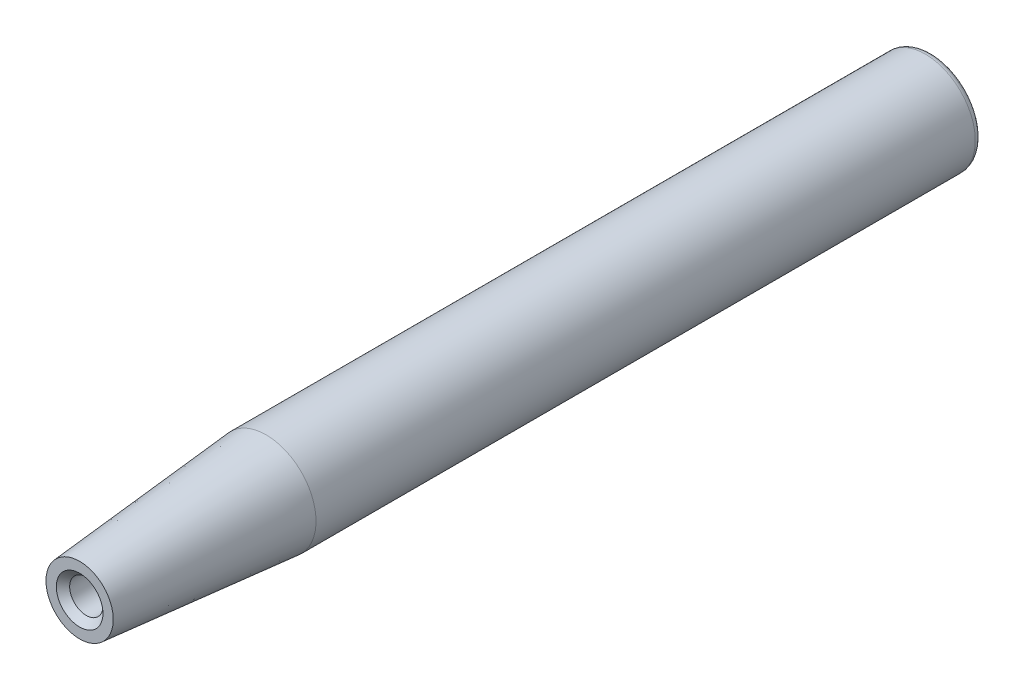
from build123d import *

# Parameters (mm, degrees)
CONG_1_R       = 1
FIXATION_D     = 5
FIXATION_DEPTH = 17
FIXATION_TIP   = 1.502151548
CHANF_1_SIZE   = 1


with BuildPart() as part:
    # Esquisse1 → Colonne (revolve)
    with BuildSketch(Plane(origin=(0, 0, 0), x_dir=(1, 0, 0), z_dir=(0, 1, 0))):
        Polygon((0, 100), (-7.5, 100), (-7.5, 0), (-5.050317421, -28), (0, -28), align=None)
    revolve(axis=Axis((0, 0, -102.874996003), (0, 0, 1)))

    # Cong_ 1
    cong_1_edges = [part.edges().sort_by_distance(p)[0] for p in [
        (7.5, 0, -100),
    ]]
    fillet(cong_1_edges, radius=CONG_1_R)

    # Fixation
    with Locations(Plane.XY.offset(28)):
        with Locations((0, 0)):
            Hole(FIXATION_D / 2, depth=FIXATION_DEPTH)
            with Locations((0, 0, -(FIXATION_DEPTH + FIXATION_TIP / 2))):  # 118° drill point
                Cone(0, FIXATION_D / 2, FIXATION_TIP, mode=Mode.SUBTRACT)

    # Chanf 1
    chanf_1_edges = [part.edges().sort_by_distance(p)[0] for p in [
        (2.5, 0, 28),
    ]]
    chamfer(chanf_1_edges, length=CHANF_1_SIZE)


solid = part.part
